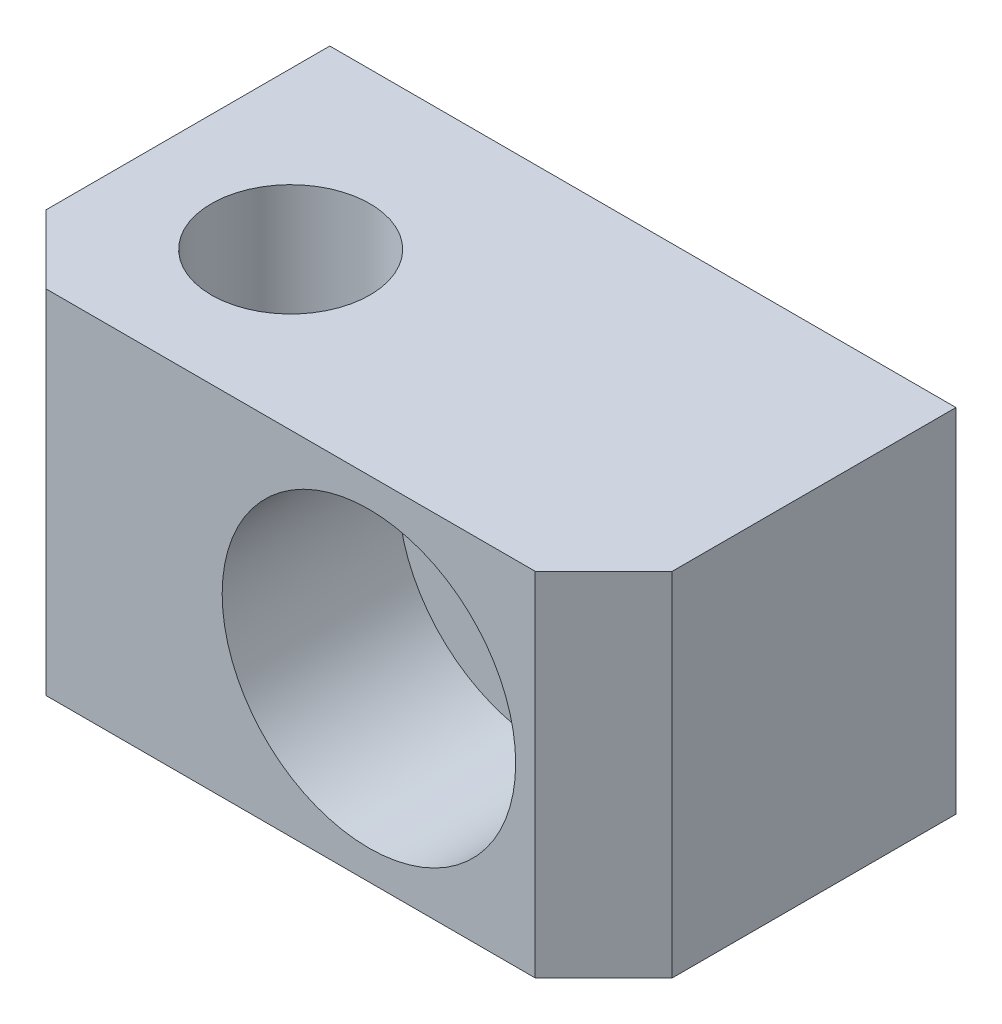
ISO-10303-21;
HEADER;
FILE_DESCRIPTION(('STEP AP214'),'2;1');
FILE_NAME('part.step','',(''),(''),'','','');
FILE_SCHEMA(('AUTOMOTIVE_DESIGN { 1 0 10303 214 1 1 1 1 }'));
ENDSEC;
DATA;
#1=APPLICATION_CONTEXT('core data for automotive mechanical design processes');
#2=APPLICATION_PROTOCOL_DEFINITION('international standard','automotive_design',2000,#1);
#3=PRODUCT_CONTEXT('',#1,'mechanical');
#4=PRODUCT('Part','Part','',(#3));
#5=PRODUCT_RELATED_PRODUCT_CATEGORY('part','',(#4));
#6=PRODUCT_DEFINITION_FORMATION('','',#4);
#7=PRODUCT_DEFINITION_CONTEXT('part definition',#1,'design');
#8=PRODUCT_DEFINITION('design','',#6,#7);
#9=PRODUCT_DEFINITION_SHAPE('','',#8);
#10=(LENGTH_UNIT() NAMED_UNIT(*) SI_UNIT(.MILLI.,.METRE.));
#11=(NAMED_UNIT(*) PLANE_ANGLE_UNIT() SI_UNIT($,.RADIAN.));
#12=(NAMED_UNIT(*) SI_UNIT($,.STERADIAN.) SOLID_ANGLE_UNIT());
#13=UNCERTAINTY_MEASURE_WITH_UNIT(LENGTH_MEASURE(1.E-05),#10,'distance_accuracy_value','');
#14=(GEOMETRIC_REPRESENTATION_CONTEXT(3) GLOBAL_UNCERTAINTY_ASSIGNED_CONTEXT((#13)) GLOBAL_UNIT_ASSIGNED_CONTEXT((#10,
#11,#12)) REPRESENTATION_CONTEXT('',''));
#15=CARTESIAN_POINT('',(0.,0.,0.));
#16=DIRECTION('',(0.,0.,1.));
#17=DIRECTION('',(1.,0.,0.));
#18=AXIS2_PLACEMENT_3D('',#15,#16,#17);
#19=CARTESIAN_POINT('',(-8.,-3.00000000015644,10.));
#20=DIRECTION('',(0.,1.,0.));
#21=DIRECTION('',(0.,0.,1.));
#22=AXIS2_PLACEMENT_3D('',#19,#20,#21);
#23=CONICAL_SURFACE('',#22,4.04999999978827,1.04719755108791);
#24=CARTESIAN_POINT('',(-8.,-5.33826859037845,10.0000000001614));
#25=VERTEX_POINT('',#24);
#26=VERTEX_LOOP('',#25);
#27=FACE_BOUND('',#26,.T.);
#28=CARTESIAN_POINT('',(-8.,-3.,10.));
#29=DIRECTION('',(0.,1.,0.));
#30=DIRECTION('',(0.,0.,1.));
#31=AXIS2_PLACEMENT_3D('',#28,#29,#30);
#32=CIRCLE('',#31,4.05);
#33=CARTESIAN_POINT('',(-8.,-3.,14.05));
#34=VERTEX_POINT('',#33);
#35=EDGE_CURVE('E76',#34,#34,#32,.T.);
#36=ORIENTED_EDGE('',*,*,#35,.T.);
#37=EDGE_LOOP('',(#36));
#38=FACE_BOUND('',#37,.T.);
#39=ADVANCED_FACE('F14',(#27,#38),#23,.F.);
#40=CARTESIAN_POINT('',(-8.,9.,10.));
#41=DIRECTION('',(0.,1.,0.));
#42=DIRECTION('',(0.,0.,1.));
#43=AXIS2_PLACEMENT_3D('',#40,#41,#42);
#44=CYLINDRICAL_SURFACE('',#43,4.05);
#45=CARTESIAN_POINT('',(-8.,9.,10.));
#46=DIRECTION('',(0.,1.,0.));
#47=DIRECTION('',(0.,0.,1.));
#48=AXIS2_PLACEMENT_3D('',#45,#46,#47);
#49=CIRCLE('',#48,4.05);
#50=CARTESIAN_POINT('',(-8.,9.,14.05));
#51=VERTEX_POINT('',#50);
#52=EDGE_CURVE('E80',#51,#51,#49,.F.);
#53=ORIENTED_EDGE('',*,*,#52,.F.);
#54=EDGE_LOOP('',(#53));
#55=FACE_BOUND('',#54,.T.);
#56=ORIENTED_EDGE('',*,*,#35,.F.);
#57=EDGE_LOOP('',(#56));
#58=FACE_BOUND('',#57,.T.);
#59=ADVANCED_FACE('F73',(#55,#58),#44,.F.);
#60=CARTESIAN_POINT('',(0.,0.,9.));
#61=DIRECTION('',(0.,0.,1.));
#62=DIRECTION('',(1.,0.,0.));
#63=AXIS2_PLACEMENT_3D('',#60,#61,#62);
#64=PLANE('',#63);
#65=CARTESIAN_POINT('',(4.,0.,9.));
#66=DIRECTION('',(0.,0.,-1.));
#67=DIRECTION('',(-1.,0.,0.));
#68=AXIS2_PLACEMENT_3D('',#65,#66,#67);
#69=CIRCLE('',#68,4.2);
#70=CARTESIAN_POINT('',(-0.2,0.,9.));
#71=VERTEX_POINT('',#70);
#72=EDGE_CURVE('E94',#71,#71,#69,.T.);
#73=ORIENTED_EDGE('',*,*,#72,.T.);
#74=EDGE_LOOP('',(#73));
#75=FACE_BOUND('',#74,.T.);
#76=CARTESIAN_POINT('',(4.,0.,9.));
#77=DIRECTION('',(0.,0.,1.));
#78=DIRECTION('',(1.,0.,0.));
#79=AXIS2_PLACEMENT_3D('',#76,#77,#78);
#80=CIRCLE('',#79,7.5);
#81=CARTESIAN_POINT('',(11.5,0.,9.));
#82=VERTEX_POINT('',#81);
#83=EDGE_CURVE('E17',#82,#82,#80,.T.);
#84=ORIENTED_EDGE('',*,*,#83,.T.);
#85=EDGE_LOOP('',(#84));
#86=FACE_BOUND('',#85,.T.);
#87=ADVANCED_FACE('F102',(#75,#86),#64,.T.);
#88=CARTESIAN_POINT('',(4.,0.,18.));
#89=DIRECTION('',(0.,0.,1.));
#90=DIRECTION('',(1.,0.,0.));
#91=AXIS2_PLACEMENT_3D('',#88,#89,#90);
#92=CYLINDRICAL_SURFACE('',#91,7.5);
#93=ORIENTED_EDGE('',*,*,#83,.F.);
#94=EDGE_LOOP('',(#93));
#95=FACE_BOUND('',#94,.T.);
#96=CARTESIAN_POINT('',(4.,0.,18.));
#97=DIRECTION('',(0.,0.,1.));
#98=DIRECTION('',(1.,0.,0.));
#99=AXIS2_PLACEMENT_3D('',#96,#97,#98);
#100=CIRCLE('',#99,7.5);
#101=CARTESIAN_POINT('',(11.5,0.,18.));
#102=VERTEX_POINT('',#101);
#103=EDGE_CURVE('E89',#102,#102,#100,.F.);
#104=ORIENTED_EDGE('',*,*,#103,.F.);
#105=EDGE_LOOP('',(#104));
#106=FACE_BOUND('',#105,.T.);
#107=ADVANCED_FACE('F108',(#95,#106),#92,.F.);
#108=CARTESIAN_POINT('',(16.,9.,0.));
#109=DIRECTION('',(0.,1.,0.));
#110=DIRECTION('',(0.,0.,1.));
#111=AXIS2_PLACEMENT_3D('',#108,#109,#110);
#112=PLANE('',#111);
#113=ORIENTED_EDGE('',*,*,#52,.T.);
#114=EDGE_LOOP('',(#113));
#115=FACE_BOUND('',#114,.T.);
#116=DIRECTION('',(0.,0.,-1.));
#117=VECTOR('',#116,1.);
#118=CARTESIAN_POINT('',(16.,9.,0.));
#119=LINE('',#118,#117);
#120=CARTESIAN_POINT('',(16.,9.,0.));
#121=VERTEX_POINT('',#120);
#122=CARTESIAN_POINT('',(16.,9.,14.5));
#123=VERTEX_POINT('',#122);
#124=EDGE_CURVE('E83',#121,#123,#119,.F.);
#125=ORIENTED_EDGE('',*,*,#124,.F.);
#126=DIRECTION('',(1.,0.,0.));
#127=VECTOR('',#126,1.);
#128=CARTESIAN_POINT('',(0.,9.,0.));
#129=LINE('',#128,#127);
#130=CARTESIAN_POINT('',(-16.,9.,0.));
#131=VERTEX_POINT('',#130);
#132=EDGE_CURVE('E182',#121,#131,#129,.F.);
#133=ORIENTED_EDGE('',*,*,#132,.T.);
#134=DIRECTION('',(0.,0.,1.));
#135=VECTOR('',#134,1.);
#136=CARTESIAN_POINT('',(-16.,9.,0.));
#137=LINE('',#136,#135);
#138=CARTESIAN_POINT('',(-16.,9.,14.5));
#139=VERTEX_POINT('',#138);
#140=EDGE_CURVE('E187',#139,#131,#137,.F.);
#141=ORIENTED_EDGE('',*,*,#140,.F.);
#142=DIRECTION('',(-0.707106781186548,0.,-0.707106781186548));
#143=VECTOR('',#142,1.);
#144=CARTESIAN_POINT('',(-12.5,9.,18.));
#145=LINE('',#144,#143);
#146=CARTESIAN_POINT('',(-12.5,9.,18.));
#147=VERTEX_POINT('',#146);
#148=EDGE_CURVE('E166',#139,#147,#145,.F.);
#149=ORIENTED_EDGE('',*,*,#148,.T.);
#150=DIRECTION('',(1.,0.,0.));
#151=VECTOR('',#150,1.);
#152=CARTESIAN_POINT('',(0.,9.,18.));
#153=LINE('',#152,#151);
#154=CARTESIAN_POINT('',(12.5,9.,18.));
#155=VERTEX_POINT('',#154);
#156=EDGE_CURVE('E93',#155,#147,#153,.F.);
#157=ORIENTED_EDGE('',*,*,#156,.F.);
#158=DIRECTION('',(-0.707106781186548,0.,0.707106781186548));
#159=VECTOR('',#158,1.);
#160=CARTESIAN_POINT('',(12.5,9.,18.));
#161=LINE('',#160,#159);
#162=EDGE_CURVE('E67',#155,#123,#161,.F.);
#163=ORIENTED_EDGE('',*,*,#162,.T.);
#164=EDGE_LOOP('',(#125,#133,#141,#149,#157,#163));
#165=FACE_BOUND('',#164,.T.);
#166=ADVANCED_FACE('F99',(#115,#165),#112,.T.);
#167=CARTESIAN_POINT('',(4.,0.,9.));
#168=DIRECTION('',(0.,0.,-1.));
#169=DIRECTION('',(-1.,0.,0.));
#170=AXIS2_PLACEMENT_3D('',#167,#168,#169);
#171=CYLINDRICAL_SURFACE('',#170,4.2);
#172=ORIENTED_EDGE('',*,*,#72,.F.);
#173=EDGE_LOOP('',(#172));
#174=FACE_BOUND('',#173,.T.);
#175=CARTESIAN_POINT('',(4.,0.,0.));
#176=DIRECTION('',(0.,0.,-1.));
#177=DIRECTION('',(-1.,0.,0.));
#178=AXIS2_PLACEMENT_3D('',#175,#176,#177);
#179=CIRCLE('',#178,4.2);
#180=CARTESIAN_POINT('',(-0.2,0.,0.));
#181=VERTEX_POINT('',#180);
#182=EDGE_CURVE('E85',#181,#181,#179,.T.);
#183=ORIENTED_EDGE('',*,*,#182,.T.);
#184=EDGE_LOOP('',(#183));
#185=FACE_BOUND('',#184,.T.);
#186=ADVANCED_FACE('F142',(#174,#185),#171,.F.);
#187=CARTESIAN_POINT('',(16.,-9.,0.));
#188=DIRECTION('',(1.,0.,0.));
#189=DIRECTION('',(0.,0.,-1.));
#190=AXIS2_PLACEMENT_3D('',#187,#188,#189);
#191=PLANE('',#190);
#192=DIRECTION('',(0.,0.,-1.));
#193=VECTOR('',#192,1.);
#194=CARTESIAN_POINT('',(16.,-9.,0.));
#195=LINE('',#194,#193);
#196=CARTESIAN_POINT('',(16.,-9.,0.));
#197=VERTEX_POINT('',#196);
#198=CARTESIAN_POINT('',(16.,-9.,14.5));
#199=VERTEX_POINT('',#198);
#200=EDGE_CURVE('E88',#197,#199,#195,.F.);
#201=ORIENTED_EDGE('',*,*,#200,.F.);
#202=DIRECTION('',(0.,1.,0.));
#203=VECTOR('',#202,1.);
#204=CARTESIAN_POINT('',(16.,0.,0.));
#205=LINE('',#204,#203);
#206=EDGE_CURVE('E184',#197,#121,#205,.T.);
#207=ORIENTED_EDGE('',*,*,#206,.T.);
#208=ORIENTED_EDGE('',*,*,#124,.T.);
#209=DIRECTION('',(0.,1.,0.));
#210=VECTOR('',#209,1.);
#211=CARTESIAN_POINT('',(16.,-9.,14.5));
#212=LINE('',#211,#210);
#213=EDGE_CURVE('E194',#123,#199,#212,.F.);
#214=ORIENTED_EDGE('',*,*,#213,.T.);
#215=EDGE_LOOP('',(#201,#207,#208,#214));
#216=FACE_BOUND('',#215,.T.);
#217=ADVANCED_FACE('F138',(#216),#191,.T.);
#218=CARTESIAN_POINT('',(12.5,-9.,18.));
#219=DIRECTION('',(-0.707106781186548,0.,-0.707106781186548));
#220=DIRECTION('',(-0.707106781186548,0.,0.707106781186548));
#221=AXIS2_PLACEMENT_3D('',#218,#219,#220);
#222=PLANE('',#221);
#223=ORIENTED_EDGE('',*,*,#213,.F.);
#224=ORIENTED_EDGE('',*,*,#162,.F.);
#225=DIRECTION('',(0.,1.,0.));
#226=VECTOR('',#225,1.);
#227=CARTESIAN_POINT('',(12.5,0.,18.));
#228=LINE('',#227,#226);
#229=CARTESIAN_POINT('',(12.5,-9.,18.));
#230=VERTEX_POINT('',#229);
#231=EDGE_CURVE('E192',#230,#155,#228,.T.);
#232=ORIENTED_EDGE('',*,*,#231,.F.);
#233=DIRECTION('',(-0.707106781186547,0.,0.707106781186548));
#234=VECTOR('',#233,1.);
#235=CARTESIAN_POINT('',(16.,-9.,14.5));
#236=LINE('',#235,#234);
#237=EDGE_CURVE('E175',#199,#230,#236,.T.);
#238=ORIENTED_EDGE('',*,*,#237,.F.);
#239=EDGE_LOOP('',(#223,#224,#232,#238));
#240=FACE_BOUND('',#239,.T.);
#241=ADVANCED_FACE('F134',(#240),#222,.F.);
#242=CARTESIAN_POINT('',(0.,0.,18.));
#243=DIRECTION('',(0.,0.,1.));
#244=DIRECTION('',(1.,0.,0.));
#245=AXIS2_PLACEMENT_3D('',#242,#243,#244);
#246=PLANE('',#245);
#247=ORIENTED_EDGE('',*,*,#103,.T.);
#248=EDGE_LOOP('',(#247));
#249=FACE_BOUND('',#248,.T.);
#250=DIRECTION('',(0.,1.,0.));
#251=VECTOR('',#250,1.);
#252=CARTESIAN_POINT('',(-12.5,9.,18.));
#253=LINE('',#252,#251);
#254=CARTESIAN_POINT('',(-12.5,-9.,18.));
#255=VERTEX_POINT('',#254);
#256=EDGE_CURVE('E92',#147,#255,#253,.F.);
#257=ORIENTED_EDGE('',*,*,#256,.T.);
#258=DIRECTION('',(1.,0.,0.));
#259=VECTOR('',#258,1.);
#260=CARTESIAN_POINT('',(-16.,-9.,18.));
#261=LINE('',#260,#259);
#262=EDGE_CURVE('E163',#230,#255,#261,.F.);
#263=ORIENTED_EDGE('',*,*,#262,.F.);
#264=ORIENTED_EDGE('',*,*,#231,.T.);
#265=ORIENTED_EDGE('',*,*,#156,.T.);
#266=EDGE_LOOP('',(#257,#263,#264,#265));
#267=FACE_BOUND('',#266,.T.);
#268=ADVANCED_FACE('F130',(#249,#267),#246,.T.);
#269=CARTESIAN_POINT('',(-12.5,9.,18.));
#270=DIRECTION('',(0.707106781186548,0.,-0.707106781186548));
#271=DIRECTION('',(-0.707106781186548,0.,-0.707106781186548));
#272=AXIS2_PLACEMENT_3D('',#269,#270,#271);
#273=PLANE('',#272);
#274=DIRECTION('',(0.,1.,0.));
#275=VECTOR('',#274,1.);
#276=CARTESIAN_POINT('',(-16.,9.,14.5));
#277=LINE('',#276,#275);
#278=CARTESIAN_POINT('',(-16.,-9.,14.5));
#279=VERTEX_POINT('',#278);
#280=EDGE_CURVE('E171',#279,#139,#277,.T.);
#281=ORIENTED_EDGE('',*,*,#280,.F.);
#282=DIRECTION('',(-0.707106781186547,0.,-0.707106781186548));
#283=VECTOR('',#282,1.);
#284=CARTESIAN_POINT('',(-12.5,-9.,18.));
#285=LINE('',#284,#283);
#286=EDGE_CURVE('E169',#255,#279,#285,.T.);
#287=ORIENTED_EDGE('',*,*,#286,.F.);
#288=ORIENTED_EDGE('',*,*,#256,.F.);
#289=ORIENTED_EDGE('',*,*,#148,.F.);
#290=EDGE_LOOP('',(#281,#287,#288,#289));
#291=FACE_BOUND('',#290,.T.);
#292=ADVANCED_FACE('F127',(#291),#273,.F.);
#293=CARTESIAN_POINT('',(-16.,9.,0.));
#294=DIRECTION('',(-1.,0.,0.));
#295=DIRECTION('',(0.,0.,1.));
#296=AXIS2_PLACEMENT_3D('',#293,#294,#295);
#297=PLANE('',#296);
#298=ORIENTED_EDGE('',*,*,#140,.T.);
#299=DIRECTION('',(0.,1.,0.));
#300=VECTOR('',#299,1.);
#301=CARTESIAN_POINT('',(-16.,0.,0.));
#302=LINE('',#301,#300);
#303=CARTESIAN_POINT('',(-16.,-9.,0.));
#304=VERTEX_POINT('',#303);
#305=EDGE_CURVE('E32',#131,#304,#302,.F.);
#306=ORIENTED_EDGE('',*,*,#305,.T.);
#307=DIRECTION('',(0.,0.,-1.));
#308=VECTOR('',#307,1.);
#309=CARTESIAN_POINT('',(-16.,-9.,0.));
#310=LINE('',#309,#308);
#311=EDGE_CURVE('E23',#279,#304,#310,.T.);
#312=ORIENTED_EDGE('',*,*,#311,.F.);
#313=ORIENTED_EDGE('',*,*,#280,.T.);
#314=EDGE_LOOP('',(#298,#306,#312,#313));
#315=FACE_BOUND('',#314,.T.);
#316=ADVANCED_FACE('F120',(#315),#297,.T.);
#317=CARTESIAN_POINT('',(0.,0.,0.));
#318=DIRECTION('',(0.,0.,1.));
#319=DIRECTION('',(1.,0.,0.));
#320=AXIS2_PLACEMENT_3D('',#317,#318,#319);
#321=PLANE('',#320);
#322=ORIENTED_EDGE('',*,*,#182,.F.);
#323=EDGE_LOOP('',(#322));
#324=FACE_BOUND('',#323,.T.);
#325=ORIENTED_EDGE('',*,*,#132,.F.);
#326=ORIENTED_EDGE('',*,*,#206,.F.);
#327=DIRECTION('',(1.,0.,0.));
#328=VECTOR('',#327,1.);
#329=CARTESIAN_POINT('',(-16.,-9.,0.));
#330=LINE('',#329,#328);
#331=EDGE_CURVE('E9',#304,#197,#330,.T.);
#332=ORIENTED_EDGE('',*,*,#331,.F.);
#333=ORIENTED_EDGE('',*,*,#305,.F.);
#334=EDGE_LOOP('',(#325,#326,#332,#333));
#335=FACE_BOUND('',#334,.T.);
#336=ADVANCED_FACE('F113',(#324,#335),#321,.F.);
#337=CARTESIAN_POINT('',(-16.,-9.,0.));
#338=DIRECTION('',(0.,-1.,0.));
#339=DIRECTION('',(0.,0.,-1.));
#340=AXIS2_PLACEMENT_3D('',#337,#338,#339);
#341=PLANE('',#340);
#342=ORIENTED_EDGE('',*,*,#311,.T.);
#343=ORIENTED_EDGE('',*,*,#331,.T.);
#344=ORIENTED_EDGE('',*,*,#200,.T.);
#345=ORIENTED_EDGE('',*,*,#237,.T.);
#346=ORIENTED_EDGE('',*,*,#262,.T.);
#347=ORIENTED_EDGE('',*,*,#286,.T.);
#348=EDGE_LOOP('',(#342,#343,#344,#345,#346,#347));
#349=FACE_BOUND('',#348,.T.);
#350=ADVANCED_FACE('F111',(#349),#341,.T.);
#351=CLOSED_SHELL('',(#39,#59,#87,#107,#166,#186,#217,#241,#268,#292,#316,#336,#350));
#352=MANIFOLD_SOLID_BREP('B1',#351);
#353=ADVANCED_BREP_SHAPE_REPRESENTATION('',(#18,#352),#14);
#354=SHAPE_DEFINITION_REPRESENTATION(#9,#353);
ENDSEC;
END-ISO-10303-21;
